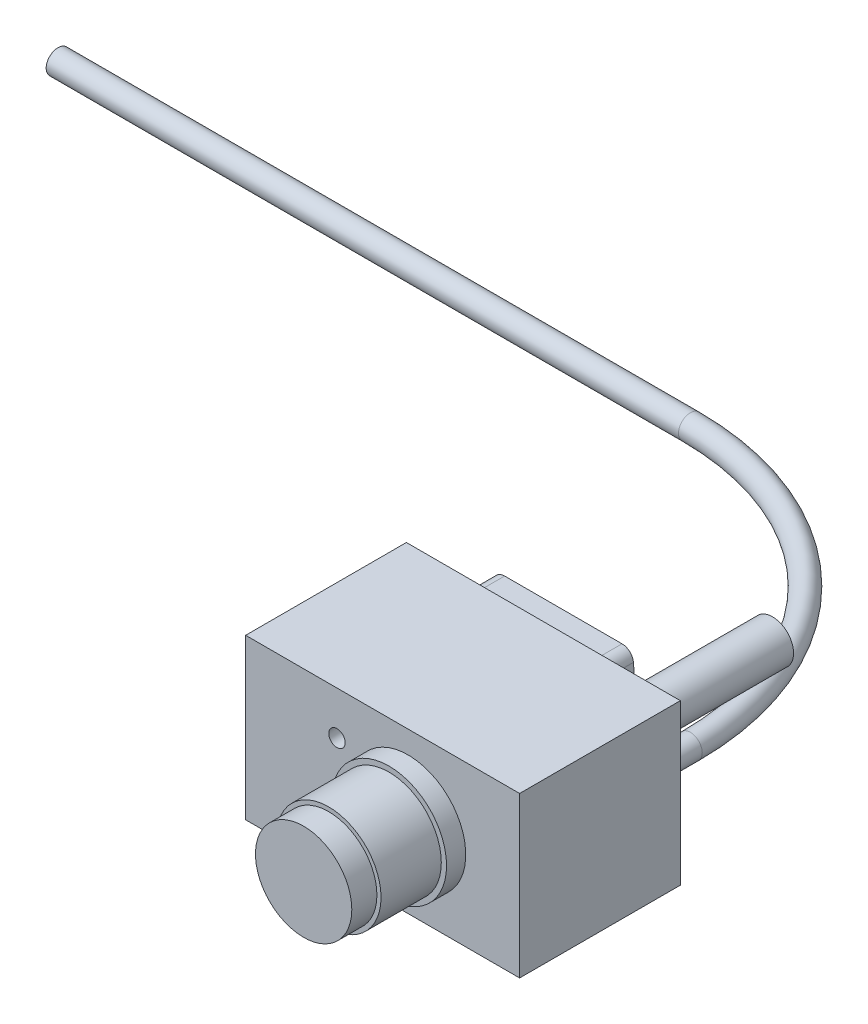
ISO-10303-21;
HEADER;
FILE_DESCRIPTION(('STEP AP214'),'2;1');
FILE_NAME('part.step','',(''),(''),'','','');
FILE_SCHEMA(('AUTOMOTIVE_DESIGN { 1 0 10303 214 1 1 1 1 }'));
ENDSEC;
DATA;
#1=APPLICATION_CONTEXT('core data for automotive mechanical design processes');
#2=APPLICATION_PROTOCOL_DEFINITION('international standard','automotive_design',2000,#1);
#3=PRODUCT_CONTEXT('',#1,'mechanical');
#4=PRODUCT('Part','Part','',(#3));
#5=PRODUCT_RELATED_PRODUCT_CATEGORY('part','',(#4));
#6=PRODUCT_DEFINITION_FORMATION('','',#4);
#7=PRODUCT_DEFINITION_CONTEXT('part definition',#1,'design');
#8=PRODUCT_DEFINITION('design','',#6,#7);
#9=PRODUCT_DEFINITION_SHAPE('','',#8);
#10=(LENGTH_UNIT() NAMED_UNIT(*) SI_UNIT(.MILLI.,.METRE.));
#11=(NAMED_UNIT(*) PLANE_ANGLE_UNIT() SI_UNIT($,.RADIAN.));
#12=(NAMED_UNIT(*) SI_UNIT($,.STERADIAN.) SOLID_ANGLE_UNIT());
#13=UNCERTAINTY_MEASURE_WITH_UNIT(LENGTH_MEASURE(1.E-05),#10,'distance_accuracy_value','');
#14=(GEOMETRIC_REPRESENTATION_CONTEXT(3) GLOBAL_UNCERTAINTY_ASSIGNED_CONTEXT((#13)) GLOBAL_UNIT_ASSIGNED_CONTEXT((#10,
#11,#12)) REPRESENTATION_CONTEXT('',''));
#15=CARTESIAN_POINT('',(0.,0.,0.));
#16=DIRECTION('',(0.,0.,1.));
#17=DIRECTION('',(1.,0.,0.));
#18=AXIS2_PLACEMENT_3D('',#15,#16,#17);
#19=CARTESIAN_POINT('',(38.1,22.225,-22.352));
#20=DIRECTION('',(0.,0.,1.));
#21=DIRECTION('',(1.,0.,0.));
#22=AXIS2_PLACEMENT_3D('',#19,#20,#21);
#23=PLANE('',#22);
#24=CARTESIAN_POINT('',(28.194,0.,-22.352));
#25=DIRECTION('',(0.,0.,1.));
#26=DIRECTION('',(1.,0.,0.));
#27=AXIS2_PLACEMENT_3D('',#24,#25,#26);
#28=CIRCLE('',#27,6.35);
#29=CARTESIAN_POINT('',(34.544,0.,-22.352));
#30=VERTEX_POINT('',#29);
#31=EDGE_CURVE('E54',#30,#30,#28,.F.);
#32=ORIENTED_EDGE('',*,*,#31,.F.);
#33=EDGE_LOOP('',(#32));
#34=FACE_BOUND('',#33,.T.);
#35=DIRECTION('',(-1.,0.,0.));
#36=VECTOR('',#35,1.);
#37=CARTESIAN_POINT('',(38.1,-22.225,-22.352));
#38=LINE('',#37,#36);
#39=CARTESIAN_POINT('',(38.1,-22.225,-22.352));
#40=VERTEX_POINT('',#39);
#41=CARTESIAN_POINT('',(-38.1,-22.225,-22.352));
#42=VERTEX_POINT('',#41);
#43=EDGE_CURVE('E233',#40,#42,#38,.T.);
#44=ORIENTED_EDGE('',*,*,#43,.T.);
#45=DIRECTION('',(0.,-1.,0.));
#46=VECTOR('',#45,1.);
#47=CARTESIAN_POINT('',(-38.1,22.225,-22.352));
#48=LINE('',#47,#46);
#49=CARTESIAN_POINT('',(-38.1,22.225,-22.352));
#50=VERTEX_POINT('',#49);
#51=EDGE_CURVE('E229',#50,#42,#48,.T.);
#52=ORIENTED_EDGE('',*,*,#51,.F.);
#53=DIRECTION('',(-1.,0.,0.));
#54=VECTOR('',#53,1.);
#55=CARTESIAN_POINT('',(38.1,22.225,-22.352));
#56=LINE('',#55,#54);
#57=CARTESIAN_POINT('',(38.1,22.225,-22.352));
#58=VERTEX_POINT('',#57);
#59=EDGE_CURVE('E105',#58,#50,#56,.T.);
#60=ORIENTED_EDGE('',*,*,#59,.F.);
#61=DIRECTION('',(0.,-1.,0.));
#62=VECTOR('',#61,1.);
#63=CARTESIAN_POINT('',(38.1,22.225,-22.352));
#64=LINE('',#63,#62);
#65=EDGE_CURVE('E249',#58,#40,#64,.T.);
#66=ORIENTED_EDGE('',*,*,#65,.T.);
#67=EDGE_LOOP('',(#44,#52,#60,#66));
#68=FACE_BOUND('',#67,.T.);
#69=CARTESIAN_POINT('',(9.50530829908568,8.22959999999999,-22.352));
#70=DIRECTION('',(0.,0.,-1.));
#71=DIRECTION('',(-1.,0.,0.));
#72=AXIS2_PLACEMENT_3D('',#69,#70,#71);
#73=CIRCLE('',#72,3.175);
#74=CARTESIAN_POINT('',(12.668226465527,8.50631948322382,-22.352));
#75=VERTEX_POINT('',#74);
#76=CARTESIAN_POINT('',(9.50530829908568,5.05459999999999,-22.352));
#77=VERTEX_POINT('',#76);
#78=EDGE_CURVE('E185',#75,#77,#73,.T.);
#79=ORIENTED_EDGE('',*,*,#78,.F.);
#80=DIRECTION('',(-0.087155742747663,0.996194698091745,0.));
#81=VECTOR('',#80,1.);
#82=CARTESIAN_POINT('',(12.668226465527,8.50631948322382,-22.352));
#83=LINE('',#82,#81);
#84=CARTESIAN_POINT('',(12.3437835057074,12.2147194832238,-22.352));
#85=VERTEX_POINT('',#84);
#86=EDGE_CURVE('E181',#75,#85,#83,.T.);
#87=ORIENTED_EDGE('',*,*,#86,.T.);
#88=CARTESIAN_POINT('',(9.18086533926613,11.938,-22.352));
#89=DIRECTION('',(0.,0.,-1.));
#90=DIRECTION('',(-1.,0.,0.));
#91=AXIS2_PLACEMENT_3D('',#88,#89,#90);
#92=CIRCLE('',#91,3.175);
#93=CARTESIAN_POINT('',(9.18086533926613,15.113,-22.352));
#94=VERTEX_POINT('',#93);
#95=EDGE_CURVE('E64',#94,#85,#92,.T.);
#96=ORIENTED_EDGE('',*,*,#95,.F.);
#97=DIRECTION('',(1.,0.,0.));
#98=VECTOR('',#97,1.);
#99=CARTESIAN_POINT('',(-23.4684124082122,15.113,-22.352));
#100=LINE('',#99,#98);
#101=CARTESIAN_POINT('',(-23.4684124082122,15.113,-22.352));
#102=VERTEX_POINT('',#101);
#103=EDGE_CURVE('E306',#102,#94,#100,.T.);
#104=ORIENTED_EDGE('',*,*,#103,.F.);
#105=CARTESIAN_POINT('',(-23.4684124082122,11.938,-22.352));
#106=DIRECTION('',(0.,0.,-1.));
#107=DIRECTION('',(-1.,0.,0.));
#108=AXIS2_PLACEMENT_3D('',#105,#106,#107);
#109=CIRCLE('',#108,3.17500000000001);
#110=CARTESIAN_POINT('',(-26.6313305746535,12.2147194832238,-22.352));
#111=VERTEX_POINT('',#110);
#112=EDGE_CURVE('E304',#111,#102,#109,.T.);
#113=ORIENTED_EDGE('',*,*,#112,.F.);
#114=DIRECTION('',(-0.0871557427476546,-0.996194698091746,0.));
#115=VECTOR('',#114,1.);
#116=CARTESIAN_POINT('',(-26.6313305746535,12.2147194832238,-22.352));
#117=LINE('',#116,#115);
#118=CARTESIAN_POINT('',(-26.955773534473,8.50631948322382,-22.352));
#119=VERTEX_POINT('',#118);
#120=EDGE_CURVE('E301',#111,#119,#117,.T.);
#121=ORIENTED_EDGE('',*,*,#120,.T.);
#122=CARTESIAN_POINT('',(-23.7928553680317,8.22959999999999,-22.352));
#123=DIRECTION('',(0.,0.,1.));
#124=DIRECTION('',(1.,0.,0.));
#125=AXIS2_PLACEMENT_3D('',#122,#123,#124);
#126=CIRCLE('',#125,3.175);
#127=CARTESIAN_POINT('',(-23.7928553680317,5.05459999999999,-22.352));
#128=VERTEX_POINT('',#127);
#129=EDGE_CURVE('E298',#119,#128,#126,.T.);
#130=ORIENTED_EDGE('',*,*,#129,.T.);
#131=DIRECTION('',(-1.,0.,0.));
#132=VECTOR('',#131,1.);
#133=CARTESIAN_POINT('',(9.50530829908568,5.05459999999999,-22.352));
#134=LINE('',#133,#132);
#135=EDGE_CURVE('E296',#77,#128,#134,.T.);
#136=ORIENTED_EDGE('',*,*,#135,.F.);
#137=EDGE_LOOP('',(#79,#87,#96,#104,#113,#121,#130,#136));
#138=FACE_BOUND('',#137,.T.);
#139=CARTESIAN_POINT('',(28.194,13.843,-22.352));
#140=DIRECTION('',(0.,0.,1.));
#141=DIRECTION('',(1.,0.,0.));
#142=AXIS2_PLACEMENT_3D('',#139,#140,#141);
#143=CIRCLE('',#142,5.842);
#144=CARTESIAN_POINT('',(34.036,13.843,-22.352));
#145=VERTEX_POINT('',#144);
#146=EDGE_CURVE('E11',#145,#145,#143,.F.);
#147=ORIENTED_EDGE('',*,*,#146,.F.);
#148=EDGE_LOOP('',(#147));
#149=FACE_BOUND('',#148,.T.);
#150=ADVANCED_FACE('F45',(#34,#68,#138,#149),#23,.F.);
#151=CARTESIAN_POINT('',(28.194,0.,-24.892));
#152=DIRECTION('',(0.,0.,-1.));
#153=DIRECTION('',(-1.,0.,0.));
#154=AXIS2_PLACEMENT_3D('',#151,#152,#153);
#155=PLANE('',#154);
#156=CARTESIAN_POINT('',(28.194,0.,-24.892));
#157=DIRECTION('',(0.,0.,-1.));
#158=DIRECTION('',(-1.,0.,0.));
#159=AXIS2_PLACEMENT_3D('',#156,#157,#158);
#160=CIRCLE('',#159,6.35);
#161=CARTESIAN_POINT('',(21.844,0.,-24.892));
#162=VERTEX_POINT('',#161);
#163=EDGE_CURVE('E262',#162,#162,#160,.T.);
#164=ORIENTED_EDGE('',*,*,#163,.T.);
#165=EDGE_LOOP('',(#164));
#166=FACE_BOUND('',#165,.T.);
#167=CARTESIAN_POINT('',(28.194,0.,-24.892));
#168=DIRECTION('',(0.,0.,-1.));
#169=DIRECTION('',(-1.,0.,0.));
#170=AXIS2_PLACEMENT_3D('',#167,#168,#169);
#171=CIRCLE('',#170,3.302);
#172=CARTESIAN_POINT('',(24.892,0.,-24.892));
#173=VERTEX_POINT('',#172);
#174=EDGE_CURVE('E259',#173,#173,#171,.F.);
#175=ORIENTED_EDGE('',*,*,#174,.T.);
#176=EDGE_LOOP('',(#175));
#177=FACE_BOUND('',#176,.T.);
#178=ADVANCED_FACE('F360',(#166,#177),#155,.T.);
#179=CARTESIAN_POINT('',(7.11200000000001,0.,44.45));
#180=DIRECTION('',(0.,0.,1.));
#181=DIRECTION('',(1.,0.,0.));
#182=AXIS2_PLACEMENT_3D('',#179,#180,#181);
#183=PLANE('',#182);
#184=CARTESIAN_POINT('',(7.11200000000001,0.,44.45));
#185=DIRECTION('',(0.,0.,1.));
#186=DIRECTION('',(1.,0.,0.));
#187=AXIS2_PLACEMENT_3D('',#184,#185,#186);
#188=CIRCLE('',#187,14.5415);
#189=CARTESIAN_POINT('',(21.6535,0.,44.45));
#190=VERTEX_POINT('',#189);
#191=EDGE_CURVE('E204',#190,#190,#188,.T.);
#192=ORIENTED_EDGE('',*,*,#191,.T.);
#193=EDGE_LOOP('',(#192));
#194=FACE_BOUND('',#193,.T.);
#195=CARTESIAN_POINT('',(7.11200000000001,0.,44.45));
#196=DIRECTION('',(0.,0.,1.));
#197=DIRECTION('',(1.,0.,0.));
#198=AXIS2_PLACEMENT_3D('',#195,#196,#197);
#199=CIRCLE('',#198,13.3985);
#200=CARTESIAN_POINT('',(20.5105,0.,44.45));
#201=VERTEX_POINT('',#200);
#202=EDGE_CURVE('E188',#201,#201,#199,.T.);
#203=ORIENTED_EDGE('',*,*,#202,.F.);
#204=EDGE_LOOP('',(#203));
#205=FACE_BOUND('',#204,.T.);
#206=ADVANCED_FACE('F365',(#194,#205),#183,.T.);
#207=CARTESIAN_POINT('',(7.11200000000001,0.,27.686));
#208=DIRECTION('',(0.,0.,1.));
#209=DIRECTION('',(1.,0.,0.));
#210=AXIS2_PLACEMENT_3D('',#207,#208,#209);
#211=PLANE('',#210);
#212=CARTESIAN_POINT('',(7.11200000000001,0.,27.686));
#213=DIRECTION('',(0.,0.,1.));
#214=DIRECTION('',(1.,0.,0.));
#215=AXIS2_PLACEMENT_3D('',#212,#213,#214);
#216=CIRCLE('',#215,16.002);
#217=CARTESIAN_POINT('',(23.114,0.,27.686));
#218=VERTEX_POINT('',#217);
#219=EDGE_CURVE('E208',#218,#218,#216,.T.);
#220=ORIENTED_EDGE('',*,*,#219,.T.);
#221=EDGE_LOOP('',(#220));
#222=FACE_BOUND('',#221,.T.);
#223=CARTESIAN_POINT('',(7.11200000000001,0.,27.686));
#224=DIRECTION('',(0.,0.,1.));
#225=DIRECTION('',(1.,0.,0.));
#226=AXIS2_PLACEMENT_3D('',#223,#224,#225);
#227=CIRCLE('',#226,14.5415);
#228=CARTESIAN_POINT('',(21.6535,0.,27.686));
#229=VERTEX_POINT('',#228);
#230=EDGE_CURVE('E202',#229,#229,#227,.T.);
#231=ORIENTED_EDGE('',*,*,#230,.F.);
#232=EDGE_LOOP('',(#231));
#233=FACE_BOUND('',#232,.T.);
#234=ADVANCED_FACE('F379',(#222,#233),#211,.T.);
#235=CARTESIAN_POINT('',(-38.1,22.225,22.352));
#236=DIRECTION('',(0.,0.,-1.));
#237=DIRECTION('',(-1.,0.,0.));
#238=AXIS2_PLACEMENT_3D('',#235,#236,#237);
#239=PLANE('',#238);
#240=CARTESIAN_POINT('',(-12.7,10.16,22.352));
#241=DIRECTION('',(0.,0.,1.));
#242=DIRECTION('',(1.,0.,0.));
#243=AXIS2_PLACEMENT_3D('',#240,#241,#242);
#244=CIRCLE('',#243,2.286);
#245=CARTESIAN_POINT('',(-10.414,10.16,22.352));
#246=VERTEX_POINT('',#245);
#247=EDGE_CURVE('E578',#246,#246,#244,.T.);
#248=ORIENTED_EDGE('',*,*,#247,.F.);
#249=EDGE_LOOP('',(#248));
#250=FACE_BOUND('',#249,.T.);
#251=CARTESIAN_POINT('',(-12.7,-10.16,22.352));
#252=DIRECTION('',(0.,0.,1.));
#253=DIRECTION('',(1.,0.,0.));
#254=AXIS2_PLACEMENT_3D('',#251,#252,#253);
#255=CIRCLE('',#254,2.286);
#256=CARTESIAN_POINT('',(-10.414,-10.16,22.352));
#257=VERTEX_POINT('',#256);
#258=EDGE_CURVE('E577',#257,#257,#255,.T.);
#259=ORIENTED_EDGE('',*,*,#258,.F.);
#260=EDGE_LOOP('',(#259));
#261=FACE_BOUND('',#260,.T.);
#262=DIRECTION('',(1.,0.,0.));
#263=VECTOR('',#262,1.);
#264=CARTESIAN_POINT('',(-38.1,-22.225,22.352));
#265=LINE('',#264,#263);
#266=CARTESIAN_POINT('',(-38.1,-22.225,22.352));
#267=VERTEX_POINT('',#266);
#268=CARTESIAN_POINT('',(38.1,-22.225,22.352));
#269=VERTEX_POINT('',#268);
#270=EDGE_CURVE('E219',#267,#269,#265,.T.);
#271=ORIENTED_EDGE('',*,*,#270,.T.);
#272=DIRECTION('',(0.,-1.,0.));
#273=VECTOR('',#272,1.);
#274=CARTESIAN_POINT('',(38.1,22.225,22.352));
#275=LINE('',#274,#273);
#276=CARTESIAN_POINT('',(38.1,22.225,22.352));
#277=VERTEX_POINT('',#276);
#278=EDGE_CURVE('E246',#277,#269,#275,.T.);
#279=ORIENTED_EDGE('',*,*,#278,.F.);
#280=DIRECTION('',(1.,0.,0.));
#281=VECTOR('',#280,1.);
#282=CARTESIAN_POINT('',(-38.1,22.225,22.352));
#283=LINE('',#282,#281);
#284=CARTESIAN_POINT('',(-38.1,22.225,22.352));
#285=VERTEX_POINT('',#284);
#286=EDGE_CURVE('E226',#285,#277,#283,.T.);
#287=ORIENTED_EDGE('',*,*,#286,.F.);
#288=DIRECTION('',(0.,-1.,0.));
#289=VECTOR('',#288,1.);
#290=CARTESIAN_POINT('',(-38.1,22.225,22.352));
#291=LINE('',#290,#289);
#292=EDGE_CURVE('E76',#285,#267,#291,.T.);
#293=ORIENTED_EDGE('',*,*,#292,.T.);
#294=EDGE_LOOP('',(#271,#279,#287,#293));
#295=FACE_BOUND('',#294,.T.);
#296=CARTESIAN_POINT('',(7.11200000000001,0.,22.352));
#297=DIRECTION('',(0.,0.,-1.));
#298=DIRECTION('',(-1.,0.,0.));
#299=AXIS2_PLACEMENT_3D('',#296,#297,#298);
#300=CIRCLE('',#299,16.002);
#301=CARTESIAN_POINT('',(-8.89,0.,22.352));
#302=VERTEX_POINT('',#301);
#303=EDGE_CURVE('E245',#302,#302,#300,.F.);
#304=ORIENTED_EDGE('',*,*,#303,.F.);
#305=EDGE_LOOP('',(#304));
#306=FACE_BOUND('',#305,.T.);
#307=ADVANCED_FACE('F376',(#250,#261,#295,#306),#239,.F.);
#308=CARTESIAN_POINT('',(-38.1,22.225,22.352));
#309=DIRECTION('',(-1.,0.,0.));
#310=DIRECTION('',(0.,0.,1.));
#311=AXIS2_PLACEMENT_3D('',#308,#309,#310);
#312=PLANE('',#311);
#313=DIRECTION('',(0.,0.,-1.));
#314=VECTOR('',#313,1.);
#315=CARTESIAN_POINT('',(-38.1,-22.225,22.352));
#316=LINE('',#315,#314);
#317=EDGE_CURVE('E215',#267,#42,#316,.T.);
#318=ORIENTED_EDGE('',*,*,#317,.F.);
#319=ORIENTED_EDGE('',*,*,#292,.F.);
#320=DIRECTION('',(0.,0.,-1.));
#321=VECTOR('',#320,1.);
#322=CARTESIAN_POINT('',(-38.1,22.225,22.352));
#323=LINE('',#322,#321);
#324=EDGE_CURVE('E216',#285,#50,#323,.T.);
#325=ORIENTED_EDGE('',*,*,#324,.T.);
#326=ORIENTED_EDGE('',*,*,#51,.T.);
#327=EDGE_LOOP('',(#318,#319,#325,#326));
#328=FACE_BOUND('',#327,.T.);
#329=ADVANCED_FACE('F47',(#328),#312,.T.);
#330=CARTESIAN_POINT('',(38.1,22.225,-22.352));
#331=DIRECTION('',(1.,0.,0.));
#332=DIRECTION('',(0.,0.,-1.));
#333=AXIS2_PLACEMENT_3D('',#330,#331,#332);
#334=PLANE('',#333);
#335=DIRECTION('',(0.,0.,1.));
#336=VECTOR('',#335,1.);
#337=CARTESIAN_POINT('',(38.1,-22.225,-22.352));
#338=LINE('',#337,#336);
#339=EDGE_CURVE('E237',#40,#269,#338,.T.);
#340=ORIENTED_EDGE('',*,*,#339,.F.);
#341=ORIENTED_EDGE('',*,*,#65,.F.);
#342=DIRECTION('',(0.,0.,1.));
#343=VECTOR('',#342,1.);
#344=CARTESIAN_POINT('',(38.1,22.225,-22.352));
#345=LINE('',#344,#343);
#346=EDGE_CURVE('E222',#58,#277,#345,.T.);
#347=ORIENTED_EDGE('',*,*,#346,.T.);
#348=ORIENTED_EDGE('',*,*,#278,.T.);
#349=EDGE_LOOP('',(#340,#341,#347,#348));
#350=FACE_BOUND('',#349,.T.);
#351=ADVANCED_FACE('F371',(#350),#334,.T.);
#352=CARTESIAN_POINT('',(-38.1,22.225,22.352));
#353=DIRECTION('',(0.,-1.,0.));
#354=DIRECTION('',(0.,0.,-1.));
#355=AXIS2_PLACEMENT_3D('',#352,#353,#354);
#356=PLANE('',#355);
#357=ORIENTED_EDGE('',*,*,#324,.F.);
#358=ORIENTED_EDGE('',*,*,#286,.T.);
#359=ORIENTED_EDGE('',*,*,#346,.F.);
#360=ORIENTED_EDGE('',*,*,#59,.T.);
#361=EDGE_LOOP('',(#357,#358,#359,#360));
#362=FACE_BOUND('',#361,.T.);
#363=ADVANCED_FACE('F374',(#362),#356,.F.);
#364=CARTESIAN_POINT('',(-38.1,-22.225,22.352));
#365=DIRECTION('',(0.,-1.,0.));
#366=DIRECTION('',(0.,0.,-1.));
#367=AXIS2_PLACEMENT_3D('',#364,#365,#366);
#368=PLANE('',#367);
#369=ORIENTED_EDGE('',*,*,#317,.T.);
#370=ORIENTED_EDGE('',*,*,#43,.F.);
#371=ORIENTED_EDGE('',*,*,#339,.T.);
#372=ORIENTED_EDGE('',*,*,#270,.F.);
#373=EDGE_LOOP('',(#369,#370,#371,#372));
#374=FACE_BOUND('',#373,.T.);
#375=ADVANCED_FACE('F381',(#374),#368,.T.);
#376=CARTESIAN_POINT('',(7.11200000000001,0.,27.686));
#377=DIRECTION('',(0.,0.,-1.));
#378=DIRECTION('',(-1.,0.,0.));
#379=AXIS2_PLACEMENT_3D('',#376,#377,#378);
#380=CYLINDRICAL_SURFACE('',#379,16.002);
#381=ORIENTED_EDGE('',*,*,#219,.F.);
#382=EDGE_LOOP('',(#381));
#383=FACE_BOUND('',#382,.T.);
#384=ORIENTED_EDGE('',*,*,#303,.T.);
#385=EDGE_LOOP('',(#384));
#386=FACE_BOUND('',#385,.T.);
#387=ADVANCED_FACE('F384',(#383,#386),#380,.T.);
#388=CARTESIAN_POINT('',(7.11200000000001,0.,44.45));
#389=DIRECTION('',(0.,0.,-1.));
#390=DIRECTION('',(-1.,0.,0.));
#391=AXIS2_PLACEMENT_3D('',#388,#389,#390);
#392=CYLINDRICAL_SURFACE('',#391,14.5415);
#393=ORIENTED_EDGE('',*,*,#191,.F.);
#394=EDGE_LOOP('',(#393));
#395=FACE_BOUND('',#394,.T.);
#396=ORIENTED_EDGE('',*,*,#230,.T.);
#397=EDGE_LOOP('',(#396));
#398=FACE_BOUND('',#397,.T.);
#399=ADVANCED_FACE('F390',(#395,#398),#392,.T.);
#400=CARTESIAN_POINT('',(7.11200000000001,0.,51.435));
#401=DIRECTION('',(0.,0.,-1.));
#402=DIRECTION('',(-1.,0.,0.));
#403=AXIS2_PLACEMENT_3D('',#400,#401,#402);
#404=CYLINDRICAL_SURFACE('',#403,13.3985);
#405=CARTESIAN_POINT('',(7.11200000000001,0.,51.435));
#406=DIRECTION('',(0.,0.,1.));
#407=DIRECTION('',(1.,0.,0.));
#408=AXIS2_PLACEMENT_3D('',#405,#406,#407);
#409=CIRCLE('',#408,13.3985);
#410=CARTESIAN_POINT('',(20.5105,0.,51.435));
#411=VERTEX_POINT('',#410);
#412=EDGE_CURVE('E194',#411,#411,#409,.T.);
#413=ORIENTED_EDGE('',*,*,#412,.F.);
#414=EDGE_LOOP('',(#413));
#415=FACE_BOUND('',#414,.T.);
#416=ORIENTED_EDGE('',*,*,#202,.T.);
#417=EDGE_LOOP('',(#416));
#418=FACE_BOUND('',#417,.T.);
#419=ADVANCED_FACE('F397',(#415,#418),#404,.T.);
#420=CARTESIAN_POINT('',(7.11200000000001,0.,51.435));
#421=DIRECTION('',(0.,0.,1.));
#422=DIRECTION('',(1.,0.,0.));
#423=AXIS2_PLACEMENT_3D('',#420,#421,#422);
#424=PLANE('',#423);
#425=ORIENTED_EDGE('',*,*,#412,.T.);
#426=EDGE_LOOP('',(#425));
#427=FACE_BOUND('',#426,.T.);
#428=ADVANCED_FACE('F404',(#427),#424,.T.);
#429=CARTESIAN_POINT('',(9.50530829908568,8.22959999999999,-35.052));
#430=DIRECTION('',(0.,0.,1.));
#431=DIRECTION('',(1.,0.,0.));
#432=AXIS2_PLACEMENT_3D('',#429,#430,#431);
#433=CYLINDRICAL_SURFACE('',#432,3.175);
#434=ORIENTED_EDGE('',*,*,#78,.T.);
#435=DIRECTION('',(0.,0.,1.));
#436=VECTOR('',#435,1.);
#437=CARTESIAN_POINT('',(9.50530829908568,5.05459999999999,-35.052));
#438=LINE('',#437,#436);
#439=CARTESIAN_POINT('',(9.50530829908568,5.05459999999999,-35.052));
#440=VERTEX_POINT('',#439);
#441=EDGE_CURVE('E164',#440,#77,#438,.T.);
#442=ORIENTED_EDGE('',*,*,#441,.F.);
#443=CARTESIAN_POINT('',(9.50530829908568,8.22959999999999,-35.052));
#444=DIRECTION('',(0.,0.,-1.));
#445=DIRECTION('',(-1.,0.,0.));
#446=AXIS2_PLACEMENT_3D('',#443,#444,#445);
#447=CIRCLE('',#446,3.175);
#448=CARTESIAN_POINT('',(12.668226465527,8.50631948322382,-35.052));
#449=VERTEX_POINT('',#448);
#450=EDGE_CURVE('E172',#449,#440,#447,.T.);
#451=ORIENTED_EDGE('',*,*,#450,.F.);
#452=DIRECTION('',(0.,0.,1.));
#453=VECTOR('',#452,1.);
#454=CARTESIAN_POINT('',(12.668226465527,8.50631948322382,-35.052));
#455=LINE('',#454,#453);
#456=EDGE_CURVE('E293',#449,#75,#455,.T.);
#457=ORIENTED_EDGE('',*,*,#456,.T.);
#458=EDGE_LOOP('',(#434,#442,#451,#457));
#459=FACE_BOUND('',#458,.T.);
#460=ADVANCED_FACE('F183',(#459),#433,.T.);
#461=CARTESIAN_POINT('',(9.50530829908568,5.05459999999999,-35.052));
#462=DIRECTION('',(0.,1.,0.));
#463=DIRECTION('',(0.,0.,1.));
#464=AXIS2_PLACEMENT_3D('',#461,#462,#463);
#465=PLANE('',#464);
#466=ORIENTED_EDGE('',*,*,#135,.T.);
#467=DIRECTION('',(0.,0.,1.));
#468=VECTOR('',#467,1.);
#469=CARTESIAN_POINT('',(-23.7928553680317,5.05459999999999,-35.052));
#470=LINE('',#469,#468);
#471=CARTESIAN_POINT('',(-23.7928553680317,5.05459999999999,-35.052));
#472=VERTEX_POINT('',#471);
#473=EDGE_CURVE('E166',#472,#128,#470,.T.);
#474=ORIENTED_EDGE('',*,*,#473,.F.);
#475=DIRECTION('',(-1.,0.,0.));
#476=VECTOR('',#475,1.);
#477=CARTESIAN_POINT('',(9.50530829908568,5.05459999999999,-35.052));
#478=LINE('',#477,#476);
#479=EDGE_CURVE('E159',#440,#472,#478,.T.);
#480=ORIENTED_EDGE('',*,*,#479,.F.);
#481=ORIENTED_EDGE('',*,*,#441,.T.);
#482=EDGE_LOOP('',(#466,#474,#480,#481));
#483=FACE_BOUND('',#482,.T.);
#484=ADVANCED_FACE('F162',(#483),#465,.F.);
#485=CARTESIAN_POINT('',(-23.7928553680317,8.22959999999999,-35.052));
#486=DIRECTION('',(0.,0.,1.));
#487=DIRECTION('',(1.,0.,0.));
#488=AXIS2_PLACEMENT_3D('',#485,#486,#487);
#489=CYLINDRICAL_SURFACE('',#488,3.175);
#490=ORIENTED_EDGE('',*,*,#129,.F.);
#491=DIRECTION('',(0.,0.,1.));
#492=VECTOR('',#491,1.);
#493=CARTESIAN_POINT('',(-26.955773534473,8.50631948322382,-35.052));
#494=LINE('',#493,#492);
#495=CARTESIAN_POINT('',(-26.955773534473,8.50631948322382,-35.052));
#496=VERTEX_POINT('',#495);
#497=EDGE_CURVE('E196',#496,#119,#494,.T.);
#498=ORIENTED_EDGE('',*,*,#497,.F.);
#499=CARTESIAN_POINT('',(-23.7928553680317,8.22959999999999,-35.052));
#500=DIRECTION('',(0.,0.,1.));
#501=DIRECTION('',(1.,0.,0.));
#502=AXIS2_PLACEMENT_3D('',#499,#500,#501);
#503=CIRCLE('',#502,3.175);
#504=EDGE_CURVE('E171',#496,#472,#503,.T.);
#505=ORIENTED_EDGE('',*,*,#504,.T.);
#506=ORIENTED_EDGE('',*,*,#473,.T.);
#507=EDGE_LOOP('',(#490,#498,#505,#506));
#508=FACE_BOUND('',#507,.T.);
#509=ADVANCED_FACE('F333',(#508),#489,.T.);
#510=CARTESIAN_POINT('',(-26.6313305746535,12.2147194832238,-35.052));
#511=DIRECTION('',(-0.996194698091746,0.0871557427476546,0.));
#512=DIRECTION('',(-0.0871557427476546,-0.996194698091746,0.));
#513=AXIS2_PLACEMENT_3D('',#510,#511,#512);
#514=PLANE('',#513);
#515=ORIENTED_EDGE('',*,*,#120,.F.);
#516=DIRECTION('',(0.,0.,1.));
#517=VECTOR('',#516,1.);
#518=CARTESIAN_POINT('',(-26.6313305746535,12.2147194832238,-35.052));
#519=LINE('',#518,#517);
#520=CARTESIAN_POINT('',(-26.6313305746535,12.2147194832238,-35.052));
#521=VERTEX_POINT('',#520);
#522=EDGE_CURVE('E325',#521,#111,#519,.T.);
#523=ORIENTED_EDGE('',*,*,#522,.F.);
#524=DIRECTION('',(-0.0871557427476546,-0.996194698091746,0.));
#525=VECTOR('',#524,1.);
#526=CARTESIAN_POINT('',(-26.6313305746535,12.2147194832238,-35.052));
#527=LINE('',#526,#525);
#528=EDGE_CURVE('E280',#521,#496,#527,.T.);
#529=ORIENTED_EDGE('',*,*,#528,.T.);
#530=ORIENTED_EDGE('',*,*,#497,.T.);
#531=EDGE_LOOP('',(#515,#523,#529,#530));
#532=FACE_BOUND('',#531,.T.);
#533=ADVANCED_FACE('F329',(#532),#514,.T.);
#534=CARTESIAN_POINT('',(-23.4684124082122,11.938,-35.052));
#535=DIRECTION('',(0.,0.,1.));
#536=DIRECTION('',(1.,0.,0.));
#537=AXIS2_PLACEMENT_3D('',#534,#535,#536);
#538=CYLINDRICAL_SURFACE('',#537,3.17500000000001);
#539=ORIENTED_EDGE('',*,*,#112,.T.);
#540=DIRECTION('',(0.,0.,1.));
#541=VECTOR('',#540,1.);
#542=CARTESIAN_POINT('',(-23.4684124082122,15.113,-35.052));
#543=LINE('',#542,#541);
#544=CARTESIAN_POINT('',(-23.4684124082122,15.113,-35.052));
#545=VERTEX_POINT('',#544);
#546=EDGE_CURVE('E322',#545,#102,#543,.T.);
#547=ORIENTED_EDGE('',*,*,#546,.F.);
#548=CARTESIAN_POINT('',(-23.4684124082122,11.938,-35.052));
#549=DIRECTION('',(0.,0.,-1.));
#550=DIRECTION('',(-1.,0.,0.));
#551=AXIS2_PLACEMENT_3D('',#548,#549,#550);
#552=CIRCLE('',#551,3.17500000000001);
#553=EDGE_CURVE('E283',#521,#545,#552,.T.);
#554=ORIENTED_EDGE('',*,*,#553,.F.);
#555=ORIENTED_EDGE('',*,*,#522,.T.);
#556=EDGE_LOOP('',(#539,#547,#554,#555));
#557=FACE_BOUND('',#556,.T.);
#558=ADVANCED_FACE('F339',(#557),#538,.T.);
#559=CARTESIAN_POINT('',(-23.4684124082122,15.113,-35.052));
#560=DIRECTION('',(0.,-1.,0.));
#561=DIRECTION('',(1.,0.,0.));
#562=AXIS2_PLACEMENT_3D('',#559,#560,#561);
#563=PLANE('',#562);
#564=ORIENTED_EDGE('',*,*,#103,.T.);
#565=DIRECTION('',(0.,0.,1.));
#566=VECTOR('',#565,1.);
#567=CARTESIAN_POINT('',(9.18086533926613,15.113,-35.052));
#568=LINE('',#567,#566);
#569=CARTESIAN_POINT('',(9.18086533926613,15.113,-35.052));
#570=VERTEX_POINT('',#569);
#571=EDGE_CURVE('E319',#570,#94,#568,.T.);
#572=ORIENTED_EDGE('',*,*,#571,.F.);
#573=DIRECTION('',(1.,0.,0.));
#574=VECTOR('',#573,1.);
#575=CARTESIAN_POINT('',(-23.4684124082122,15.113,-35.052));
#576=LINE('',#575,#574);
#577=EDGE_CURVE('E285',#545,#570,#576,.T.);
#578=ORIENTED_EDGE('',*,*,#577,.F.);
#579=ORIENTED_EDGE('',*,*,#546,.T.);
#580=EDGE_LOOP('',(#564,#572,#578,#579));
#581=FACE_BOUND('',#580,.T.);
#582=ADVANCED_FACE('F343',(#581),#563,.F.);
#583=CARTESIAN_POINT('',(9.18086533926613,11.938,-35.052));
#584=DIRECTION('',(0.,0.,1.));
#585=DIRECTION('',(1.,0.,0.));
#586=AXIS2_PLACEMENT_3D('',#583,#584,#585);
#587=CYLINDRICAL_SURFACE('',#586,3.175);
#588=ORIENTED_EDGE('',*,*,#95,.T.);
#589=DIRECTION('',(0.,0.,1.));
#590=VECTOR('',#589,1.);
#591=CARTESIAN_POINT('',(12.3437835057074,12.2147194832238,-35.052));
#592=LINE('',#591,#590);
#593=CARTESIAN_POINT('',(12.3437835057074,12.2147194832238,-35.052));
#594=VERTEX_POINT('',#593);
#595=EDGE_CURVE('E316',#594,#85,#592,.T.);
#596=ORIENTED_EDGE('',*,*,#595,.F.);
#597=CARTESIAN_POINT('',(9.18086533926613,11.938,-35.052));
#598=DIRECTION('',(0.,0.,-1.));
#599=DIRECTION('',(-1.,0.,0.));
#600=AXIS2_PLACEMENT_3D('',#597,#598,#599);
#601=CIRCLE('',#600,3.175);
#602=EDGE_CURVE('E288',#570,#594,#601,.T.);
#603=ORIENTED_EDGE('',*,*,#602,.F.);
#604=ORIENTED_EDGE('',*,*,#571,.T.);
#605=EDGE_LOOP('',(#588,#596,#603,#604));
#606=FACE_BOUND('',#605,.T.);
#607=ADVANCED_FACE('F346',(#606),#587,.T.);
#608=CARTESIAN_POINT('',(12.668226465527,8.50631948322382,-35.052));
#609=DIRECTION('',(0.996194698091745,0.087155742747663,0.));
#610=DIRECTION('',(-0.087155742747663,0.996194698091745,0.));
#611=AXIS2_PLACEMENT_3D('',#608,#609,#610);
#612=PLANE('',#611);
#613=ORIENTED_EDGE('',*,*,#86,.F.);
#614=ORIENTED_EDGE('',*,*,#456,.F.);
#615=DIRECTION('',(-0.087155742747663,0.996194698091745,0.));
#616=VECTOR('',#615,1.);
#617=CARTESIAN_POINT('',(12.668226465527,8.50631948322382,-35.052));
#618=LINE('',#617,#616);
#619=EDGE_CURVE('E178',#449,#594,#618,.T.);
#620=ORIENTED_EDGE('',*,*,#619,.T.);
#621=ORIENTED_EDGE('',*,*,#595,.T.);
#622=EDGE_LOOP('',(#613,#614,#620,#621));
#623=FACE_BOUND('',#622,.T.);
#624=ADVANCED_FACE('F349',(#623),#612,.T.);
#625=CARTESIAN_POINT('',(9.50530829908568,8.22959999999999,-35.052));
#626=DIRECTION('',(0.,0.,-1.));
#627=DIRECTION('',(-1.,0.,0.));
#628=AXIS2_PLACEMENT_3D('',#625,#626,#627);
#629=PLANE('',#628);
#630=ORIENTED_EDGE('',*,*,#450,.T.);
#631=ORIENTED_EDGE('',*,*,#479,.T.);
#632=ORIENTED_EDGE('',*,*,#504,.F.);
#633=ORIENTED_EDGE('',*,*,#528,.F.);
#634=ORIENTED_EDGE('',*,*,#553,.T.);
#635=ORIENTED_EDGE('',*,*,#577,.T.);
#636=ORIENTED_EDGE('',*,*,#602,.T.);
#637=ORIENTED_EDGE('',*,*,#619,.F.);
#638=EDGE_LOOP('',(#630,#631,#632,#633,#634,#635,#636,#637));
#639=FACE_BOUND('',#638,.T.);
#640=ADVANCED_FACE('F176',(#639),#629,.T.);
#641=CARTESIAN_POINT('',(28.194,0.,-24.892));
#642=DIRECTION('',(0.,0.,1.));
#643=DIRECTION('',(1.,0.,0.));
#644=AXIS2_PLACEMENT_3D('',#641,#642,#643);
#645=CYLINDRICAL_SURFACE('',#644,6.35);
#646=ORIENTED_EDGE('',*,*,#163,.F.);
#647=EDGE_LOOP('',(#646));
#648=FACE_BOUND('',#647,.T.);
#649=ORIENTED_EDGE('',*,*,#31,.T.);
#650=EDGE_LOOP('',(#649));
#651=FACE_BOUND('',#650,.T.);
#652=ADVANCED_FACE('F356',(#648,#651),#645,.T.);
#653=CARTESIAN_POINT('',(-48.7852376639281,2.67956206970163E-13,-112.031237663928));
#654=DIRECTION('',(-1.,0.,0.));
#655=DIRECTION('',(0.,-1.,0.));
#656=AXIS2_PLACEMENT_3D('',#653,#654,#655);
#657=CYLINDRICAL_SURFACE('',#656,3.302);
#658=CARTESIAN_POINT('',(-48.7852376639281,2.67956206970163E-13,-112.031237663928));
#659=DIRECTION('',(-1.,0.,0.));
#660=DIRECTION('',(0.,0.,1.));
#661=AXIS2_PLACEMENT_3D('',#658,#659,#660);
#662=CIRCLE('',#661,3.302);
#663=CARTESIAN_POINT('',(-48.7852376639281,2.67956206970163E-13,-115.333237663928));
#664=VERTEX_POINT('',#663);
#665=EDGE_CURVE('E270',#664,#664,#662,.T.);
#666=ORIENTED_EDGE('',*,*,#665,.T.);
#667=EDGE_LOOP('',(#666));
#668=FACE_BOUND('',#667,.T.);
#669=CARTESIAN_POINT('',(-224.658396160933,8.80151207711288E-13,-112.031237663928));
#670=DIRECTION('',(-1.,0.,0.));
#671=DIRECTION('',(0.,0.,1.));
#672=AXIS2_PLACEMENT_3D('',#669,#670,#671);
#673=CIRCLE('',#672,3.302);
#674=CARTESIAN_POINT('',(-224.658396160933,8.6865731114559E-13,-108.729237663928));
#675=VERTEX_POINT('',#674);
#676=EDGE_CURVE('E263',#675,#675,#673,.T.);
#677=ORIENTED_EDGE('',*,*,#676,.F.);
#678=EDGE_LOOP('',(#677));
#679=FACE_BOUND('',#678,.T.);
#680=ADVANCED_FACE('F447',(#668,#679),#657,.T.);
#681=CARTESIAN_POINT('',(-48.7852376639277,2.67956206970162E-13,-35.052));
#682=DIRECTION('',(0.,1.,0.));
#683=DIRECTION('',(-1.,0.,0.));
#684=AXIS2_PLACEMENT_3D('',#681,#682,#683);
#685=TOROIDAL_SURFACE('',#684,76.9792376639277,3.302);
#686=CARTESIAN_POINT('',(28.194,0.,-35.052));
#687=DIRECTION('',(0.,0.,-1.));
#688=DIRECTION('',(-1.,0.,0.));
#689=AXIS2_PLACEMENT_3D('',#686,#687,#688);
#690=CIRCLE('',#689,3.302);
#691=CARTESIAN_POINT('',(31.496,0.,-35.052));
#692=VERTEX_POINT('',#691);
#693=EDGE_CURVE('E275',#692,#692,#690,.T.);
#694=CARTESIAN_POINT('',(-48.7852376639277,2.67956206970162E-13,-35.052));
#695=DIRECTION('',(0.,1.,0.));
#696=DIRECTION('',(-1.,0.,0.));
#697=AXIS2_PLACEMENT_3D('',#694,#695,#696);
#698=CIRCLE('',#697,80.2812376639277);
#699=EDGE_CURVE('',#692,#664,#698,.T.);
#700=ORIENTED_EDGE('',*,*,#693,.T.);
#701=ORIENTED_EDGE('',*,*,#665,.F.);
#702=ORIENTED_EDGE('',*,*,#699,.T.);
#703=ORIENTED_EDGE('',*,*,#699,.F.);
#704=EDGE_LOOP('',(#700,#702,#701,#703));
#705=FACE_BOUND('',#704,.T.);
#706=ADVANCED_FACE('F463',(#705),#685,.T.);
#707=CARTESIAN_POINT('',(28.194,0.,-35.052));
#708=DIRECTION('',(0.,0.,1.));
#709=DIRECTION('',(1.,0.,0.));
#710=AXIS2_PLACEMENT_3D('',#707,#708,#709);
#711=CYLINDRICAL_SURFACE('',#710,3.302);
#712=ORIENTED_EDGE('',*,*,#174,.F.);
#713=EDGE_LOOP('',(#712));
#714=FACE_BOUND('',#713,.T.);
#715=ORIENTED_EDGE('',*,*,#693,.F.);
#716=EDGE_LOOP('',(#715));
#717=FACE_BOUND('',#716,.T.);
#718=ADVANCED_FACE('F473',(#714,#717),#711,.T.);
#719=CARTESIAN_POINT('',(-224.658396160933,8.80151207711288E-13,-112.031237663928));
#720=DIRECTION('',(-1.,0.,0.));
#721=DIRECTION('',(0.,0.,1.));
#722=AXIS2_PLACEMENT_3D('',#719,#720,#721);
#723=PLANE('',#722);
#724=ORIENTED_EDGE('',*,*,#676,.T.);
#725=EDGE_LOOP('',(#724));
#726=FACE_BOUND('',#725,.T.);
#727=ADVANCED_FACE('F484',(#726),#723,.T.);
#728=CARTESIAN_POINT('',(28.194,13.843,-57.912));
#729=DIRECTION('',(0.,0.,1.));
#730=DIRECTION('',(1.,0.,0.));
#731=AXIS2_PLACEMENT_3D('',#728,#729,#730);
#732=CYLINDRICAL_SURFACE('',#731,5.842);
#733=CARTESIAN_POINT('',(28.194,13.843,-57.912));
#734=DIRECTION('',(0.,0.,-1.));
#735=DIRECTION('',(-1.,0.,0.));
#736=AXIS2_PLACEMENT_3D('',#733,#734,#735);
#737=CIRCLE('',#736,5.842);
#738=CARTESIAN_POINT('',(22.352,13.843,-57.912));
#739=VERTEX_POINT('',#738);
#740=EDGE_CURVE('E590',#739,#739,#737,.T.);
#741=ORIENTED_EDGE('',*,*,#740,.F.);
#742=EDGE_LOOP('',(#741));
#743=FACE_BOUND('',#742,.T.);
#744=ORIENTED_EDGE('',*,*,#146,.T.);
#745=EDGE_LOOP('',(#744));
#746=FACE_BOUND('',#745,.T.);
#747=ADVANCED_FACE('F494',(#743,#746),#732,.T.);
#748=CARTESIAN_POINT('',(28.194,13.843,-57.912));
#749=DIRECTION('',(0.,0.,-1.));
#750=DIRECTION('',(-1.,0.,0.));
#751=AXIS2_PLACEMENT_3D('',#748,#749,#750);
#752=PLANE('',#751);
#753=ORIENTED_EDGE('',*,*,#740,.T.);
#754=EDGE_LOOP('',(#753));
#755=FACE_BOUND('',#754,.T.);
#756=ADVANCED_FACE('F510',(#755),#752,.T.);
#757=CARTESIAN_POINT('',(-12.7,-10.16,9.65199999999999));
#758=DIRECTION('',(0.,0.,1.));
#759=DIRECTION('',(1.,0.,0.));
#760=AXIS2_PLACEMENT_3D('',#757,#758,#759);
#761=CYLINDRICAL_SURFACE('',#760,2.286);
#762=CARTESIAN_POINT('',(-12.7,-10.16,9.65199999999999));
#763=DIRECTION('',(0.,0.,1.));
#764=DIRECTION('',(1.,0.,0.));
#765=AXIS2_PLACEMENT_3D('',#762,#763,#764);
#766=CIRCLE('',#765,2.286);
#767=CARTESIAN_POINT('',(-10.414,-10.16,9.65199999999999));
#768=VERTEX_POINT('',#767);
#769=EDGE_CURVE('E583',#768,#768,#766,.T.);
#770=ORIENTED_EDGE('',*,*,#769,.F.);
#771=EDGE_LOOP('',(#770));
#772=FACE_BOUND('',#771,.T.);
#773=ORIENTED_EDGE('',*,*,#258,.T.);
#774=EDGE_LOOP('',(#773));
#775=FACE_BOUND('',#774,.T.);
#776=ADVANCED_FACE('F520',(#772,#775),#761,.F.);
#777=CARTESIAN_POINT('',(-12.7,-10.16,9.65199999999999));
#778=DIRECTION('',(0.,0.,1.));
#779=DIRECTION('',(1.,0.,0.));
#780=AXIS2_PLACEMENT_3D('',#777,#778,#779);
#781=PLANE('',#780);
#782=ORIENTED_EDGE('',*,*,#769,.T.);
#783=EDGE_LOOP('',(#782));
#784=FACE_BOUND('',#783,.T.);
#785=ADVANCED_FACE('F540',(#784),#781,.T.);
#786=CARTESIAN_POINT('',(-12.7,10.16,9.65199999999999));
#787=DIRECTION('',(0.,0.,1.));
#788=DIRECTION('',(1.,0.,0.));
#789=AXIS2_PLACEMENT_3D('',#786,#787,#788);
#790=CYLINDRICAL_SURFACE('',#789,2.286);
#791=CARTESIAN_POINT('',(-12.7,10.16,9.65199999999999));
#792=DIRECTION('',(0.,0.,1.));
#793=DIRECTION('',(1.,0.,0.));
#794=AXIS2_PLACEMENT_3D('',#791,#792,#793);
#795=CIRCLE('',#794,2.286);
#796=CARTESIAN_POINT('',(-10.414,10.16,9.65199999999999));
#797=VERTEX_POINT('',#796);
#798=EDGE_CURVE('E576',#797,#797,#795,.T.);
#799=ORIENTED_EDGE('',*,*,#798,.F.);
#800=EDGE_LOOP('',(#799));
#801=FACE_BOUND('',#800,.T.);
#802=ORIENTED_EDGE('',*,*,#247,.T.);
#803=EDGE_LOOP('',(#802));
#804=FACE_BOUND('',#803,.T.);
#805=ADVANCED_FACE('F550',(#801,#804),#790,.F.);
#806=CARTESIAN_POINT('',(-12.7,10.16,9.65199999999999));
#807=DIRECTION('',(0.,0.,1.));
#808=DIRECTION('',(1.,0.,0.));
#809=AXIS2_PLACEMENT_3D('',#806,#807,#808);
#810=PLANE('',#809);
#811=ORIENTED_EDGE('',*,*,#798,.T.);
#812=EDGE_LOOP('',(#811));
#813=FACE_BOUND('',#812,.T.);
#814=ADVANCED_FACE('F560',(#813),#810,.T.);
#815=CLOSED_SHELL('',(#150,#178,#206,#234,#307,#329,#351,#363,#375,#387,#399,#419,#428,#460,
#484,#509,#533,#558,#582,#607,#624,#640,#652,#680,#706,#718,#727,#747,#756,#776,#785,#805,#814));
#816=MANIFOLD_SOLID_BREP('B2',#815);
#817=ADVANCED_BREP_SHAPE_REPRESENTATION('',(#18,#816),#14);
#818=SHAPE_DEFINITION_REPRESENTATION(#9,#817);
ENDSEC;
END-ISO-10303-21;
